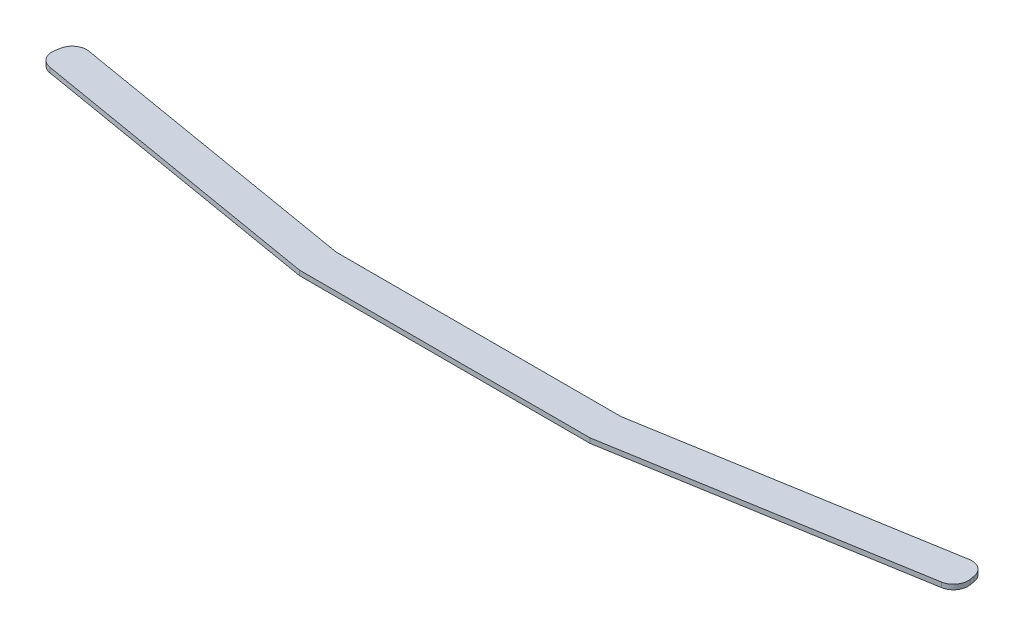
from build123d import *

# Parameters (mm, degrees)
EXTRUDE_1_DEPTH = 1


with BuildPart() as part:
    # Sketch 1 → Extrude 1 (new body)
    with BuildSketch(Plane(origin=(0, 0, 0), x_dir=(1, 0, 0), z_dir=(0, 1, 0))):
        with BuildLine():
            Line((-30, 0), (30, 0))
            Line((30, 0), (92.042057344, 10.499425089))
            ThreePointArc((92.042057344, 10.499425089), (93.987023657, 11.719746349), (94.499425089, 13.957942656))
            Line((94.499425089, 13.957942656), (94.332566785, 14.943923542))
            ThreePointArc((94.332566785, 14.943923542), (93.112245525, 16.888889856), (90.874049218, 17.401291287))
            Line((90.874049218, 17.401291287), (29.41187343, 7))
            Line((29.41187343, 7), (-29.41187343, 7))
            Line((-29.41187343, 7), (-90.874049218, 17.401291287))
            ThreePointArc((-90.874049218, 17.401291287), (-93.112245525, 16.888889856), (-94.332566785, 14.943923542))
            Line((-94.332566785, 14.943923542), (-94.499425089, 13.957942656))
            ThreePointArc((-94.499425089, 13.957942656), (-93.987023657, 11.719746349), (-92.042057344, 10.499425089))
            Line((-92.042057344, 10.499425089), (-30, 0))
        make_face()
    extrude(amount=EXTRUDE_1_DEPTH)


solid = part.part
